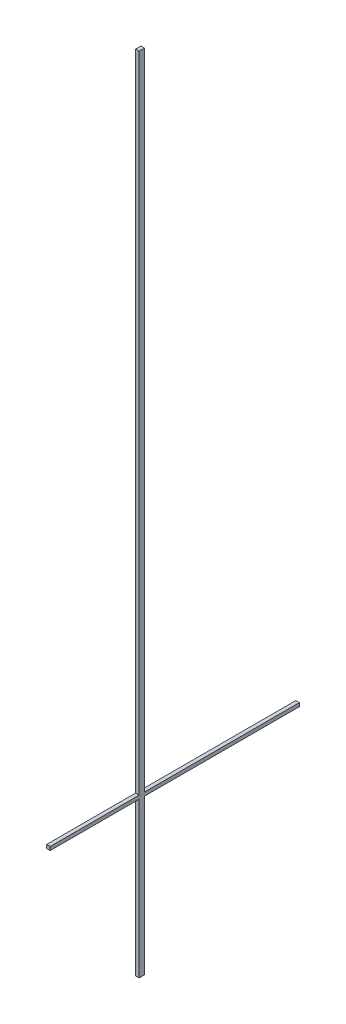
ISO-10303-21;
HEADER;
FILE_DESCRIPTION(('STEP AP214'),'2;1');
FILE_NAME('part.step','',(''),(''),'','','');
FILE_SCHEMA(('AUTOMOTIVE_DESIGN { 1 0 10303 214 1 1 1 1 }'));
ENDSEC;
DATA;
#1=APPLICATION_CONTEXT('core data for automotive mechanical design processes');
#2=APPLICATION_PROTOCOL_DEFINITION('international standard','automotive_design',2000,#1);
#3=PRODUCT_CONTEXT('',#1,'mechanical');
#4=PRODUCT('Part','Part','',(#3));
#5=PRODUCT_RELATED_PRODUCT_CATEGORY('part','',(#4));
#6=PRODUCT_DEFINITION_FORMATION('','',#4);
#7=PRODUCT_DEFINITION_CONTEXT('part definition',#1,'design');
#8=PRODUCT_DEFINITION('design','',#6,#7);
#9=PRODUCT_DEFINITION_SHAPE('','',#8);
#10=(LENGTH_UNIT() NAMED_UNIT(*) SI_UNIT(.MILLI.,.METRE.));
#11=(NAMED_UNIT(*) PLANE_ANGLE_UNIT() SI_UNIT($,.RADIAN.));
#12=(NAMED_UNIT(*) SI_UNIT($,.STERADIAN.) SOLID_ANGLE_UNIT());
#13=UNCERTAINTY_MEASURE_WITH_UNIT(LENGTH_MEASURE(1.E-05),#10,'distance_accuracy_value','');
#14=(GEOMETRIC_REPRESENTATION_CONTEXT(3) GLOBAL_UNCERTAINTY_ASSIGNED_CONTEXT((#13)) GLOBAL_UNIT_ASSIGNED_CONTEXT((#10,
#11,#12)) REPRESENTATION_CONTEXT('',''));
#15=CARTESIAN_POINT('',(0.,0.,0.));
#16=DIRECTION('',(0.,0.,1.));
#17=DIRECTION('',(1.,0.,0.));
#18=AXIS2_PLACEMENT_3D('',#15,#16,#17);
#19=CARTESIAN_POINT('',(0.,2710.,0.));
#20=DIRECTION('',(0.,0.,-1.));
#21=DIRECTION('',(-1.,0.,0.));
#22=AXIS2_PLACEMENT_3D('',#19,#20,#21);
#23=PLANE('',#22);
#24=DIRECTION('',(-1.,0.,0.));
#25=VECTOR('',#24,1.);
#26=CARTESIAN_POINT('',(0.,-910.,0.));
#27=LINE('',#26,#25);
#28=CARTESIAN_POINT('',(20.,-910.,0.));
#29=VERTEX_POINT('',#28);
#30=CARTESIAN_POINT('',(0.,-910.,0.));
#31=VERTEX_POINT('',#30);
#32=EDGE_CURVE('E56',#29,#31,#27,.T.);
#33=ORIENTED_EDGE('',*,*,#32,.F.);
#34=DIRECTION('',(0.,-1.,0.));
#35=VECTOR('',#34,1.);
#36=CARTESIAN_POINT('',(20.,2710.,0.));
#37=LINE('',#36,#35);
#38=CARTESIAN_POINT('',(20.,2710.,0.));
#39=VERTEX_POINT('',#38);
#40=EDGE_CURVE('E269',#39,#29,#37,.T.);
#41=ORIENTED_EDGE('',*,*,#40,.F.);
#42=DIRECTION('',(1.,0.,0.));
#43=VECTOR('',#42,1.);
#44=CARTESIAN_POINT('',(0.,2710.,0.));
#45=LINE('',#44,#43);
#46=CARTESIAN_POINT('',(0.,2710.,0.));
#47=VERTEX_POINT('',#46);
#48=EDGE_CURVE('E246',#47,#39,#45,.T.);
#49=ORIENTED_EDGE('',*,*,#48,.F.);
#50=DIRECTION('',(0.,-1.,0.));
#51=VECTOR('',#50,1.);
#52=CARTESIAN_POINT('',(0.,2710.,0.));
#53=LINE('',#52,#51);
#54=EDGE_CURVE('E11',#47,#31,#53,.T.);
#55=ORIENTED_EDGE('',*,*,#54,.T.);
#56=EDGE_LOOP('',(#33,#41,#49,#55));
#57=FACE_BOUND('',#56,.T.);
#58=ADVANCED_FACE('F40',(#57),#23,.F.);
#59=DIRECTION('',(1.,0.,0.));
#60=VECTOR('',#59,1.);
#61=CARTESIAN_POINT('',(0.,-930.,0.));
#62=LINE('',#61,#60);
#63=CARTESIAN_POINT('',(0.,-930.,0.));
#64=VERTEX_POINT('',#63);
#65=CARTESIAN_POINT('',(20.,-930.,0.));
#66=VERTEX_POINT('',#65);
#67=EDGE_CURVE('E64',#64,#66,#62,.T.);
#68=ORIENTED_EDGE('',*,*,#67,.F.);
#69=CARTESIAN_POINT('',(0.,-1800.,0.));
#70=VERTEX_POINT('',#69);
#71=EDGE_CURVE('E49',#64,#70,#53,.T.);
#72=ORIENTED_EDGE('',*,*,#71,.T.);
#73=DIRECTION('',(-1.,0.,0.));
#74=VECTOR('',#73,1.);
#75=CARTESIAN_POINT('',(0.,-1800.,0.));
#76=LINE('',#75,#74);
#77=CARTESIAN_POINT('',(20.,-1800.,0.));
#78=VERTEX_POINT('',#77);
#79=EDGE_CURVE('E254',#78,#70,#76,.T.);
#80=ORIENTED_EDGE('',*,*,#79,.F.);
#81=EDGE_CURVE('E227',#66,#78,#37,.T.);
#82=ORIENTED_EDGE('',*,*,#81,.F.);
#83=EDGE_LOOP('',(#68,#72,#80,#82));
#84=FACE_BOUND('',#83,.T.);
#85=ADVANCED_FACE('F268',(#84),#23,.F.);
#86=CARTESIAN_POINT('',(0.,2710.,-30.));
#87=DIRECTION('',(0.,0.,1.));
#88=DIRECTION('',(1.,0.,0.));
#89=AXIS2_PLACEMENT_3D('',#86,#87,#88);
#90=PLANE('',#89);
#91=DIRECTION('',(1.,0.,0.));
#92=VECTOR('',#91,1.);
#93=CARTESIAN_POINT('',(20.,-910.,-30.));
#94=LINE('',#93,#92);
#95=CARTESIAN_POINT('',(0.,-910.,-30.));
#96=VERTEX_POINT('',#95);
#97=CARTESIAN_POINT('',(20.,-910.,-30.));
#98=VERTEX_POINT('',#97);
#99=EDGE_CURVE('E156',#96,#98,#94,.T.);
#100=ORIENTED_EDGE('',*,*,#99,.F.);
#101=DIRECTION('',(0.,-1.,0.));
#102=VECTOR('',#101,1.);
#103=CARTESIAN_POINT('',(0.,2710.,-30.));
#104=LINE('',#103,#102);
#105=CARTESIAN_POINT('',(0.,2710.,-30.));
#106=VERTEX_POINT('',#105);
#107=EDGE_CURVE('E236',#106,#96,#104,.T.);
#108=ORIENTED_EDGE('',*,*,#107,.F.);
#109=DIRECTION('',(-1.,0.,0.));
#110=VECTOR('',#109,1.);
#111=CARTESIAN_POINT('',(0.,2710.,-30.));
#112=LINE('',#111,#110);
#113=CARTESIAN_POINT('',(20.,2710.,-30.));
#114=VERTEX_POINT('',#113);
#115=EDGE_CURVE('E233',#114,#106,#112,.T.);
#116=ORIENTED_EDGE('',*,*,#115,.F.);
#117=DIRECTION('',(0.,-1.,0.));
#118=VECTOR('',#117,1.);
#119=CARTESIAN_POINT('',(20.,2710.,-30.));
#120=LINE('',#119,#118);
#121=EDGE_CURVE('E224',#114,#98,#120,.T.);
#122=ORIENTED_EDGE('',*,*,#121,.T.);
#123=EDGE_LOOP('',(#100,#108,#116,#122));
#124=FACE_BOUND('',#123,.T.);
#125=ADVANCED_FACE('F294',(#124),#90,.F.);
#126=DIRECTION('',(-1.,0.,0.));
#127=VECTOR('',#126,1.);
#128=CARTESIAN_POINT('',(20.,-930.,-30.));
#129=LINE('',#128,#127);
#130=CARTESIAN_POINT('',(20.,-930.,-30.));
#131=VERTEX_POINT('',#130);
#132=CARTESIAN_POINT('',(0.,-930.,-30.));
#133=VERTEX_POINT('',#132);
#134=EDGE_CURVE('E153',#131,#133,#129,.T.);
#135=ORIENTED_EDGE('',*,*,#134,.F.);
#136=CARTESIAN_POINT('',(20.,-1800.,-30.));
#137=VERTEX_POINT('',#136);
#138=EDGE_CURVE('E228',#131,#137,#120,.T.);
#139=ORIENTED_EDGE('',*,*,#138,.T.);
#140=DIRECTION('',(1.,0.,0.));
#141=VECTOR('',#140,1.);
#142=CARTESIAN_POINT('',(0.,-1800.,-30.));
#143=LINE('',#142,#141);
#144=CARTESIAN_POINT('',(0.,-1800.,-30.));
#145=VERTEX_POINT('',#144);
#146=EDGE_CURVE('E261',#145,#137,#143,.T.);
#147=ORIENTED_EDGE('',*,*,#146,.F.);
#148=EDGE_CURVE('E192',#133,#145,#104,.T.);
#149=ORIENTED_EDGE('',*,*,#148,.F.);
#150=EDGE_LOOP('',(#135,#139,#147,#149));
#151=FACE_BOUND('',#150,.T.);
#152=ADVANCED_FACE('F301',(#151),#90,.F.);
#153=CARTESIAN_POINT('',(0.,2710.,0.));
#154=DIRECTION('',(1.,0.,0.));
#155=DIRECTION('',(0.,0.,-1.));
#156=AXIS2_PLACEMENT_3D('',#153,#154,#155);
#157=PLANE('',#156);
#158=ORIENTED_EDGE('',*,*,#107,.T.);
#159=DIRECTION('',(0.,0.,1.));
#160=VECTOR('',#159,1.);
#161=CARTESIAN_POINT('',(0.,-910.,-900.));
#162=LINE('',#161,#160);
#163=CARTESIAN_POINT('',(0.,-910.,-900.));
#164=VERTEX_POINT('',#163);
#165=EDGE_CURVE('E199',#164,#96,#162,.T.);
#166=ORIENTED_EDGE('',*,*,#165,.F.);
#167=DIRECTION('',(0.,1.,0.));
#168=VECTOR('',#167,1.);
#169=CARTESIAN_POINT('',(0.,-930.,-900.));
#170=LINE('',#169,#168);
#171=CARTESIAN_POINT('',(0.,-930.,-900.));
#172=VERTEX_POINT('',#171);
#173=EDGE_CURVE('E179',#172,#164,#170,.T.);
#174=ORIENTED_EDGE('',*,*,#173,.F.);
#175=DIRECTION('',(0.,0.,1.));
#176=VECTOR('',#175,1.);
#177=CARTESIAN_POINT('',(0.,-930.,-900.));
#178=LINE('',#177,#176);
#179=EDGE_CURVE('E195',#172,#133,#178,.T.);
#180=ORIENTED_EDGE('',*,*,#179,.T.);
#181=ORIENTED_EDGE('',*,*,#148,.T.);
#182=DIRECTION('',(0.,0.,-1.));
#183=VECTOR('',#182,1.);
#184=CARTESIAN_POINT('',(0.,-1800.,0.));
#185=LINE('',#184,#183);
#186=EDGE_CURVE('E204',#70,#145,#185,.T.);
#187=ORIENTED_EDGE('',*,*,#186,.F.);
#188=ORIENTED_EDGE('',*,*,#71,.F.);
#189=DIRECTION('',(0.,0.,-1.));
#190=VECTOR('',#189,1.);
#191=CARTESIAN_POINT('',(0.,-930.,500.));
#192=LINE('',#191,#190);
#193=CARTESIAN_POINT('',(0.,-930.,500.));
#194=VERTEX_POINT('',#193);
#195=EDGE_CURVE('E135',#194,#64,#192,.T.);
#196=ORIENTED_EDGE('',*,*,#195,.F.);
#197=DIRECTION('',(0.,-1.,0.));
#198=VECTOR('',#197,1.);
#199=CARTESIAN_POINT('',(0.,-930.,500.));
#200=LINE('',#199,#198);
#201=CARTESIAN_POINT('',(0.,-910.,500.));
#202=VERTEX_POINT('',#201);
#203=EDGE_CURVE('E141',#202,#194,#200,.T.);
#204=ORIENTED_EDGE('',*,*,#203,.F.);
#205=DIRECTION('',(0.,0.,-1.));
#206=VECTOR('',#205,1.);
#207=CARTESIAN_POINT('',(0.,-910.,500.));
#208=LINE('',#207,#206);
#209=EDGE_CURVE('E167',#202,#31,#208,.T.);
#210=ORIENTED_EDGE('',*,*,#209,.T.);
#211=ORIENTED_EDGE('',*,*,#54,.F.);
#212=DIRECTION('',(0.,0.,1.));
#213=VECTOR('',#212,1.);
#214=CARTESIAN_POINT('',(0.,2710.,0.));
#215=LINE('',#214,#213);
#216=EDGE_CURVE('E250',#106,#47,#215,.T.);
#217=ORIENTED_EDGE('',*,*,#216,.F.);
#218=EDGE_LOOP('',(#158,#166,#174,#180,#181,#187,#188,#196,#204,#210,#211,#217));
#219=FACE_BOUND('',#218,.T.);
#220=ADVANCED_FACE('F42',(#219),#157,.F.);
#221=CARTESIAN_POINT('',(20.,2710.,0.));
#222=DIRECTION('',(-1.,0.,0.));
#223=DIRECTION('',(0.,0.,1.));
#224=AXIS2_PLACEMENT_3D('',#221,#222,#223);
#225=PLANE('',#224);
#226=ORIENTED_EDGE('',*,*,#40,.T.);
#227=DIRECTION('',(0.,0.,-1.));
#228=VECTOR('',#227,1.);
#229=CARTESIAN_POINT('',(20.,-910.,500.));
#230=LINE('',#229,#228);
#231=CARTESIAN_POINT('',(20.,-910.,500.));
#232=VERTEX_POINT('',#231);
#233=EDGE_CURVE('E158',#232,#29,#230,.T.);
#234=ORIENTED_EDGE('',*,*,#233,.F.);
#235=DIRECTION('',(0.,1.,0.));
#236=VECTOR('',#235,1.);
#237=CARTESIAN_POINT('',(20.,-930.,500.));
#238=LINE('',#237,#236);
#239=CARTESIAN_POINT('',(20.,-930.,500.));
#240=VERTEX_POINT('',#239);
#241=EDGE_CURVE('E140',#240,#232,#238,.T.);
#242=ORIENTED_EDGE('',*,*,#241,.F.);
#243=DIRECTION('',(0.,0.,-1.));
#244=VECTOR('',#243,1.);
#245=CARTESIAN_POINT('',(20.,-930.,500.));
#246=LINE('',#245,#244);
#247=EDGE_CURVE('E137',#240,#66,#246,.T.);
#248=ORIENTED_EDGE('',*,*,#247,.T.);
#249=ORIENTED_EDGE('',*,*,#81,.T.);
#250=DIRECTION('',(0.,0.,1.));
#251=VECTOR('',#250,1.);
#252=CARTESIAN_POINT('',(20.,-1800.,0.));
#253=LINE('',#252,#251);
#254=EDGE_CURVE('E258',#137,#78,#253,.T.);
#255=ORIENTED_EDGE('',*,*,#254,.F.);
#256=ORIENTED_EDGE('',*,*,#138,.F.);
#257=DIRECTION('',(0.,0.,1.));
#258=VECTOR('',#257,1.);
#259=CARTESIAN_POINT('',(20.,-930.,-900.));
#260=LINE('',#259,#258);
#261=CARTESIAN_POINT('',(20.,-930.,-900.));
#262=VERTEX_POINT('',#261);
#263=EDGE_CURVE('E198',#262,#131,#260,.T.);
#264=ORIENTED_EDGE('',*,*,#263,.F.);
#265=DIRECTION('',(0.,-1.,0.));
#266=VECTOR('',#265,1.);
#267=CARTESIAN_POINT('',(20.,-930.,-900.));
#268=LINE('',#267,#266);
#269=CARTESIAN_POINT('',(20.,-910.,-900.));
#270=VERTEX_POINT('',#269);
#271=EDGE_CURVE('E174',#270,#262,#268,.T.);
#272=ORIENTED_EDGE('',*,*,#271,.F.);
#273=DIRECTION('',(0.,0.,1.));
#274=VECTOR('',#273,1.);
#275=CARTESIAN_POINT('',(20.,-910.,-900.));
#276=LINE('',#275,#274);
#277=EDGE_CURVE('E185',#270,#98,#276,.T.);
#278=ORIENTED_EDGE('',*,*,#277,.T.);
#279=ORIENTED_EDGE('',*,*,#121,.F.);
#280=DIRECTION('',(0.,0.,-1.));
#281=VECTOR('',#280,1.);
#282=CARTESIAN_POINT('',(20.,2710.,0.));
#283=LINE('',#282,#281);
#284=EDGE_CURVE('E242',#39,#114,#283,.T.);
#285=ORIENTED_EDGE('',*,*,#284,.F.);
#286=EDGE_LOOP('',(#226,#234,#242,#248,#249,#255,#256,#264,#272,#278,#279,#285));
#287=FACE_BOUND('',#286,.T.);
#288=ADVANCED_FACE('F275',(#287),#225,.F.);
#289=CARTESIAN_POINT('',(0.,2710.,0.));
#290=DIRECTION('',(0.,-1.,0.));
#291=DIRECTION('',(0.,0.,-1.));
#292=AXIS2_PLACEMENT_3D('',#289,#290,#291);
#293=PLANE('',#292);
#294=ORIENTED_EDGE('',*,*,#216,.T.);
#295=ORIENTED_EDGE('',*,*,#48,.T.);
#296=ORIENTED_EDGE('',*,*,#284,.T.);
#297=ORIENTED_EDGE('',*,*,#115,.T.);
#298=EDGE_LOOP('',(#294,#295,#296,#297));
#299=FACE_BOUND('',#298,.T.);
#300=ADVANCED_FACE('F298',(#299),#293,.F.);
#301=CARTESIAN_POINT('',(0.,-1800.,0.));
#302=DIRECTION('',(0.,-1.,0.));
#303=DIRECTION('',(0.,0.,-1.));
#304=AXIS2_PLACEMENT_3D('',#301,#302,#303);
#305=PLANE('',#304);
#306=ORIENTED_EDGE('',*,*,#186,.T.);
#307=ORIENTED_EDGE('',*,*,#146,.T.);
#308=ORIENTED_EDGE('',*,*,#254,.T.);
#309=ORIENTED_EDGE('',*,*,#79,.T.);
#310=EDGE_LOOP('',(#306,#307,#308,#309));
#311=FACE_BOUND('',#310,.T.);
#312=ADVANCED_FACE('F265',(#311),#305,.T.);
#313=CARTESIAN_POINT('',(20.,-930.,-900.));
#314=DIRECTION('',(0.,1.,0.));
#315=DIRECTION('',(0.,0.,1.));
#316=AXIS2_PLACEMENT_3D('',#313,#314,#315);
#317=PLANE('',#316);
#318=ORIENTED_EDGE('',*,*,#134,.T.);
#319=ORIENTED_EDGE('',*,*,#179,.F.);
#320=DIRECTION('',(-1.,0.,0.));
#321=VECTOR('',#320,1.);
#322=CARTESIAN_POINT('',(20.,-930.,-900.));
#323=LINE('',#322,#321);
#324=EDGE_CURVE('E177',#262,#172,#323,.T.);
#325=ORIENTED_EDGE('',*,*,#324,.F.);
#326=ORIENTED_EDGE('',*,*,#263,.T.);
#327=EDGE_LOOP('',(#318,#319,#325,#326));
#328=FACE_BOUND('',#327,.T.);
#329=ADVANCED_FACE('F307',(#328),#317,.F.);
#330=CARTESIAN_POINT('',(20.,-910.,-900.));
#331=DIRECTION('',(0.,-1.,0.));
#332=DIRECTION('',(0.,0.,-1.));
#333=AXIS2_PLACEMENT_3D('',#330,#331,#332);
#334=PLANE('',#333);
#335=ORIENTED_EDGE('',*,*,#99,.T.);
#336=ORIENTED_EDGE('',*,*,#277,.F.);
#337=DIRECTION('',(1.,0.,0.));
#338=VECTOR('',#337,1.);
#339=CARTESIAN_POINT('',(20.,-910.,-900.));
#340=LINE('',#339,#338);
#341=EDGE_CURVE('E182',#164,#270,#340,.T.);
#342=ORIENTED_EDGE('',*,*,#341,.F.);
#343=ORIENTED_EDGE('',*,*,#165,.T.);
#344=EDGE_LOOP('',(#335,#336,#342,#343));
#345=FACE_BOUND('',#344,.T.);
#346=ADVANCED_FACE('F310',(#345),#334,.F.);
#347=CARTESIAN_POINT('',(0.,0.,-900.));
#348=DIRECTION('',(0.,0.,1.));
#349=DIRECTION('',(1.,0.,0.));
#350=AXIS2_PLACEMENT_3D('',#347,#348,#349);
#351=PLANE('',#350);
#352=ORIENTED_EDGE('',*,*,#271,.T.);
#353=ORIENTED_EDGE('',*,*,#324,.T.);
#354=ORIENTED_EDGE('',*,*,#173,.T.);
#355=ORIENTED_EDGE('',*,*,#341,.T.);
#356=EDGE_LOOP('',(#352,#353,#354,#355));
#357=FACE_BOUND('',#356,.T.);
#358=ADVANCED_FACE('F288',(#357),#351,.F.);
#359=CARTESIAN_POINT('',(0.,-930.,500.));
#360=DIRECTION('',(0.,1.,0.));
#361=DIRECTION('',(-1.,0.,0.));
#362=AXIS2_PLACEMENT_3D('',#359,#360,#361);
#363=PLANE('',#362);
#364=ORIENTED_EDGE('',*,*,#67,.T.);
#365=ORIENTED_EDGE('',*,*,#247,.F.);
#366=DIRECTION('',(1.,0.,0.));
#367=VECTOR('',#366,1.);
#368=CARTESIAN_POINT('',(0.,-930.,500.));
#369=LINE('',#368,#367);
#370=EDGE_CURVE('E131',#194,#240,#369,.T.);
#371=ORIENTED_EDGE('',*,*,#370,.F.);
#372=ORIENTED_EDGE('',*,*,#195,.T.);
#373=EDGE_LOOP('',(#364,#365,#371,#372));
#374=FACE_BOUND('',#373,.T.);
#375=ADVANCED_FACE('F133',(#374),#363,.F.);
#376=CARTESIAN_POINT('',(0.,-910.,500.));
#377=DIRECTION('',(0.,-1.,0.));
#378=DIRECTION('',(0.,0.,-1.));
#379=AXIS2_PLACEMENT_3D('',#376,#377,#378);
#380=PLANE('',#379);
#381=ORIENTED_EDGE('',*,*,#32,.T.);
#382=ORIENTED_EDGE('',*,*,#209,.F.);
#383=DIRECTION('',(-1.,0.,0.));
#384=VECTOR('',#383,1.);
#385=CARTESIAN_POINT('',(0.,-910.,500.));
#386=LINE('',#385,#384);
#387=EDGE_CURVE('E146',#232,#202,#386,.T.);
#388=ORIENTED_EDGE('',*,*,#387,.F.);
#389=ORIENTED_EDGE('',*,*,#233,.T.);
#390=EDGE_LOOP('',(#381,#382,#388,#389));
#391=FACE_BOUND('',#390,.T.);
#392=ADVANCED_FACE('F280',(#391),#380,.F.);
#393=CARTESIAN_POINT('',(0.,0.,500.));
#394=DIRECTION('',(0.,0.,-1.));
#395=DIRECTION('',(-1.,0.,0.));
#396=AXIS2_PLACEMENT_3D('',#393,#394,#395);
#397=PLANE('',#396);
#398=ORIENTED_EDGE('',*,*,#203,.T.);
#399=ORIENTED_EDGE('',*,*,#370,.T.);
#400=ORIENTED_EDGE('',*,*,#241,.T.);
#401=ORIENTED_EDGE('',*,*,#387,.T.);
#402=EDGE_LOOP('',(#398,#399,#400,#401));
#403=FACE_BOUND('',#402,.T.);
#404=ADVANCED_FACE('F144',(#403),#397,.F.);
#405=CLOSED_SHELL('',(#58,#85,#125,#152,#220,#288,#300,#312,#329,#346,#358,#375,#392,#404));
#406=MANIFOLD_SOLID_BREP('B2',#405);
#407=ADVANCED_BREP_SHAPE_REPRESENTATION('',(#18,#406),#14);
#408=SHAPE_DEFINITION_REPRESENTATION(#9,#407);
ENDSEC;
END-ISO-10303-21;
